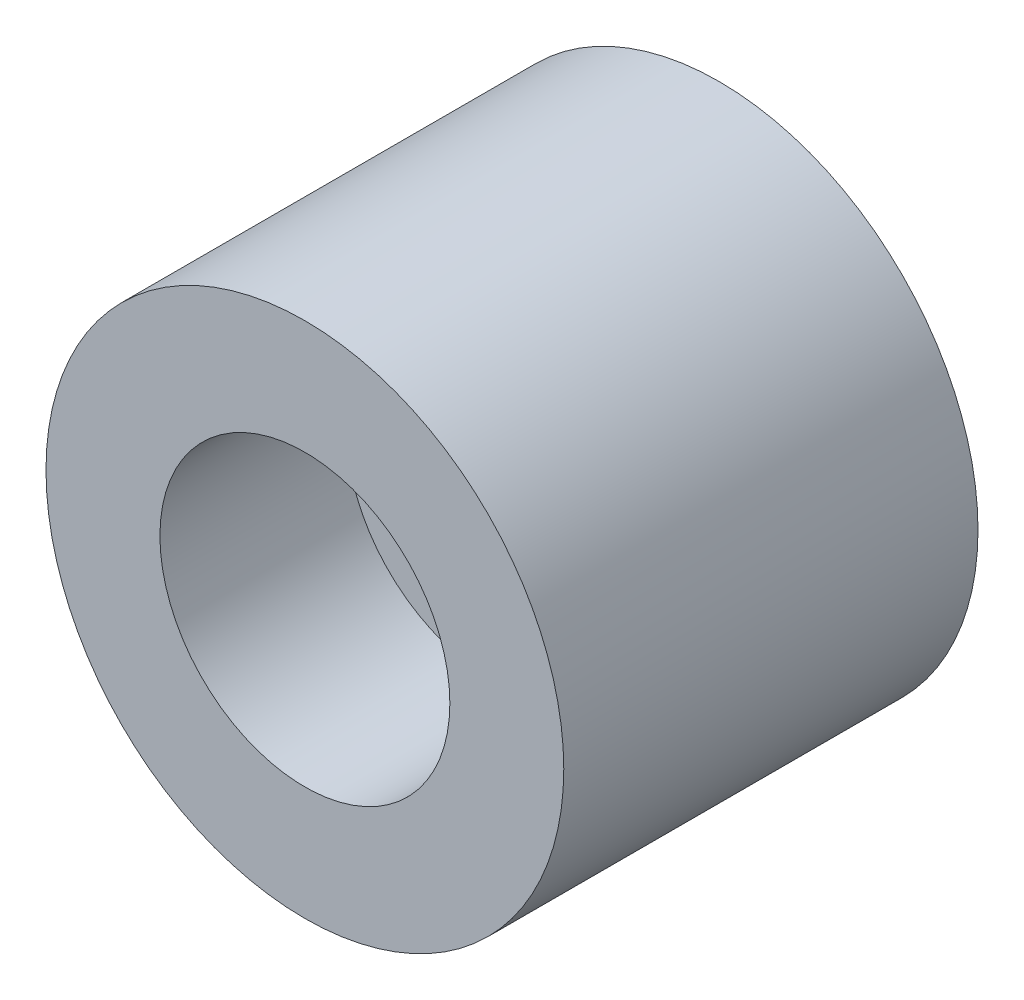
ISO-10303-21;
HEADER;
FILE_DESCRIPTION(('STEP AP214'),'2;1');
FILE_NAME('part.step','',(''),(''),'','','');
FILE_SCHEMA(('AUTOMOTIVE_DESIGN { 1 0 10303 214 1 1 1 1 }'));
ENDSEC;
DATA;
#1=APPLICATION_CONTEXT('core data for automotive mechanical design processes');
#2=APPLICATION_PROTOCOL_DEFINITION('international standard','automotive_design',2000,#1);
#3=PRODUCT_CONTEXT('',#1,'mechanical');
#4=PRODUCT('Part','Part','',(#3));
#5=PRODUCT_RELATED_PRODUCT_CATEGORY('part','',(#4));
#6=PRODUCT_DEFINITION_FORMATION('','',#4);
#7=PRODUCT_DEFINITION_CONTEXT('part definition',#1,'design');
#8=PRODUCT_DEFINITION('design','',#6,#7);
#9=PRODUCT_DEFINITION_SHAPE('','',#8);
#10=(LENGTH_UNIT() NAMED_UNIT(*) SI_UNIT(.MILLI.,.METRE.));
#11=(NAMED_UNIT(*) PLANE_ANGLE_UNIT() SI_UNIT($,.RADIAN.));
#12=(NAMED_UNIT(*) SI_UNIT($,.STERADIAN.) SOLID_ANGLE_UNIT());
#13=UNCERTAINTY_MEASURE_WITH_UNIT(LENGTH_MEASURE(1.E-05),#10,'distance_accuracy_value','');
#14=(GEOMETRIC_REPRESENTATION_CONTEXT(3) GLOBAL_UNCERTAINTY_ASSIGNED_CONTEXT((#13)) GLOBAL_UNIT_ASSIGNED_CONTEXT((#10,
#11,#12)) REPRESENTATION_CONTEXT('',''));
#15=CARTESIAN_POINT('',(0.,0.,0.));
#16=DIRECTION('',(0.,0.,1.));
#17=DIRECTION('',(1.,0.,0.));
#18=AXIS2_PLACEMENT_3D('',#15,#16,#17);
#19=CARTESIAN_POINT('',(0.,0.,20.));
#20=DIRECTION('',(0.,0.,1.));
#21=DIRECTION('',(1.,0.,0.));
#22=AXIS2_PLACEMENT_3D('',#19,#20,#21);
#23=PLANE('',#22);
#24=CARTESIAN_POINT('',(0.,0.,20.));
#25=DIRECTION('',(0.,0.,1.));
#26=DIRECTION('',(1.,0.,0.));
#27=AXIS2_PLACEMENT_3D('',#24,#25,#26);
#28=CIRCLE('',#27,12.5);
#29=CARTESIAN_POINT('',(12.5,0.,20.));
#30=VERTEX_POINT('',#29);
#31=EDGE_CURVE('E8',#30,#30,#28,.T.);
#32=ORIENTED_EDGE('',*,*,#31,.T.);
#33=EDGE_LOOP('',(#32));
#34=FACE_BOUND('',#33,.T.);
#35=CARTESIAN_POINT('',(0.,0.,20.));
#36=DIRECTION('',(0.,0.,1.));
#37=DIRECTION('',(1.,0.,0.));
#38=AXIS2_PLACEMENT_3D('',#35,#36,#37);
#39=CIRCLE('',#38,7.);
#40=CARTESIAN_POINT('',(7.,0.,20.));
#41=VERTEX_POINT('',#40);
#42=EDGE_CURVE('E32',#41,#41,#39,.T.);
#43=ORIENTED_EDGE('',*,*,#42,.F.);
#44=EDGE_LOOP('',(#43));
#45=FACE_BOUND('',#44,.T.);
#46=ADVANCED_FACE('F12',(#34,#45),#23,.T.);
#47=CARTESIAN_POINT('',(0.,0.,0.));
#48=DIRECTION('',(0.,0.,1.));
#49=DIRECTION('',(1.,0.,0.));
#50=AXIS2_PLACEMENT_3D('',#47,#48,#49);
#51=PLANE('',#50);
#52=CARTESIAN_POINT('',(0.,0.,0.));
#53=DIRECTION('',(0.,0.,1.));
#54=DIRECTION('',(1.,0.,0.));
#55=AXIS2_PLACEMENT_3D('',#52,#53,#54);
#56=CIRCLE('',#55,12.5);
#57=CARTESIAN_POINT('',(12.5,0.,0.));
#58=VERTEX_POINT('',#57);
#59=EDGE_CURVE('E20',#58,#58,#56,.T.);
#60=ORIENTED_EDGE('',*,*,#59,.F.);
#61=EDGE_LOOP('',(#60));
#62=FACE_BOUND('',#61,.T.);
#63=CARTESIAN_POINT('',(0.,0.,0.));
#64=DIRECTION('',(0.,0.,1.));
#65=DIRECTION('',(1.,0.,0.));
#66=AXIS2_PLACEMENT_3D('',#63,#64,#65);
#67=CIRCLE('',#66,3.5);
#68=CARTESIAN_POINT('',(3.5,0.,0.));
#69=VERTEX_POINT('',#68);
#70=EDGE_CURVE('E16',#69,#69,#67,.F.);
#71=ORIENTED_EDGE('',*,*,#70,.F.);
#72=EDGE_LOOP('',(#71));
#73=FACE_BOUND('',#72,.T.);
#74=ADVANCED_FACE('F40',(#62,#73),#51,.F.);
#75=CARTESIAN_POINT('',(0.,0.,20.));
#76=DIRECTION('',(0.,0.,-1.));
#77=DIRECTION('',(-1.,0.,0.));
#78=AXIS2_PLACEMENT_3D('',#75,#76,#77);
#79=CYLINDRICAL_SURFACE('',#78,12.5);
#80=ORIENTED_EDGE('',*,*,#31,.F.);
#81=EDGE_LOOP('',(#80));
#82=FACE_BOUND('',#81,.T.);
#83=ORIENTED_EDGE('',*,*,#59,.T.);
#84=EDGE_LOOP('',(#83));
#85=FACE_BOUND('',#84,.T.);
#86=ADVANCED_FACE('F14',(#82,#85),#79,.T.);
#87=CARTESIAN_POINT('',(0.,0.,20.));
#88=DIRECTION('',(0.,0.,1.));
#89=DIRECTION('',(1.,0.,0.));
#90=AXIS2_PLACEMENT_3D('',#87,#88,#89);
#91=CYLINDRICAL_SURFACE('',#90,3.5);
#92=CARTESIAN_POINT('',(0.,0.,11.));
#93=DIRECTION('',(0.,0.,1.));
#94=DIRECTION('',(1.,0.,0.));
#95=AXIS2_PLACEMENT_3D('',#92,#93,#94);
#96=CIRCLE('',#95,3.5);
#97=CARTESIAN_POINT('',(3.5,0.,11.));
#98=VERTEX_POINT('',#97);
#99=EDGE_CURVE('E26',#98,#98,#96,.T.);
#100=ORIENTED_EDGE('',*,*,#99,.T.);
#101=EDGE_LOOP('',(#100));
#102=FACE_BOUND('',#101,.T.);
#103=ORIENTED_EDGE('',*,*,#70,.T.);
#104=EDGE_LOOP('',(#103));
#105=FACE_BOUND('',#104,.T.);
#106=ADVANCED_FACE('F49',(#102,#105),#91,.F.);
#107=CARTESIAN_POINT('',(3.5,0.,11.));
#108=DIRECTION('',(0.,0.,1.));
#109=DIRECTION('',(1.,0.,0.));
#110=AXIS2_PLACEMENT_3D('',#107,#108,#109);
#111=PLANE('',#110);
#112=CARTESIAN_POINT('',(0.,0.,11.));
#113=DIRECTION('',(0.,0.,1.));
#114=DIRECTION('',(1.,0.,0.));
#115=AXIS2_PLACEMENT_3D('',#112,#113,#114);
#116=CIRCLE('',#115,7.);
#117=CARTESIAN_POINT('',(7.,0.,11.));
#118=VERTEX_POINT('',#117);
#119=EDGE_CURVE('E29',#118,#118,#116,.T.);
#120=ORIENTED_EDGE('',*,*,#119,.T.);
#121=EDGE_LOOP('',(#120));
#122=FACE_BOUND('',#121,.T.);
#123=ORIENTED_EDGE('',*,*,#99,.F.);
#124=EDGE_LOOP('',(#123));
#125=FACE_BOUND('',#124,.T.);
#126=ADVANCED_FACE('F52',(#122,#125),#111,.T.);
#127=CARTESIAN_POINT('',(0.,0.,20.));
#128=DIRECTION('',(0.,0.,1.));
#129=DIRECTION('',(1.,0.,0.));
#130=AXIS2_PLACEMENT_3D('',#127,#128,#129);
#131=CYLINDRICAL_SURFACE('',#130,7.);
#132=ORIENTED_EDGE('',*,*,#42,.T.);
#133=EDGE_LOOP('',(#132));
#134=FACE_BOUND('',#133,.T.);
#135=ORIENTED_EDGE('',*,*,#119,.F.);
#136=EDGE_LOOP('',(#135));
#137=FACE_BOUND('',#136,.T.);
#138=ADVANCED_FACE('F36',(#134,#137),#131,.F.);
#139=CLOSED_SHELL('',(#46,#74,#86,#106,#126,#138));
#140=MANIFOLD_SOLID_BREP('B1',#139);
#141=ADVANCED_BREP_SHAPE_REPRESENTATION('',(#18,#140),#14);
#142=SHAPE_DEFINITION_REPRESENTATION(#9,#141);
ENDSEC;
END-ISO-10303-21;
